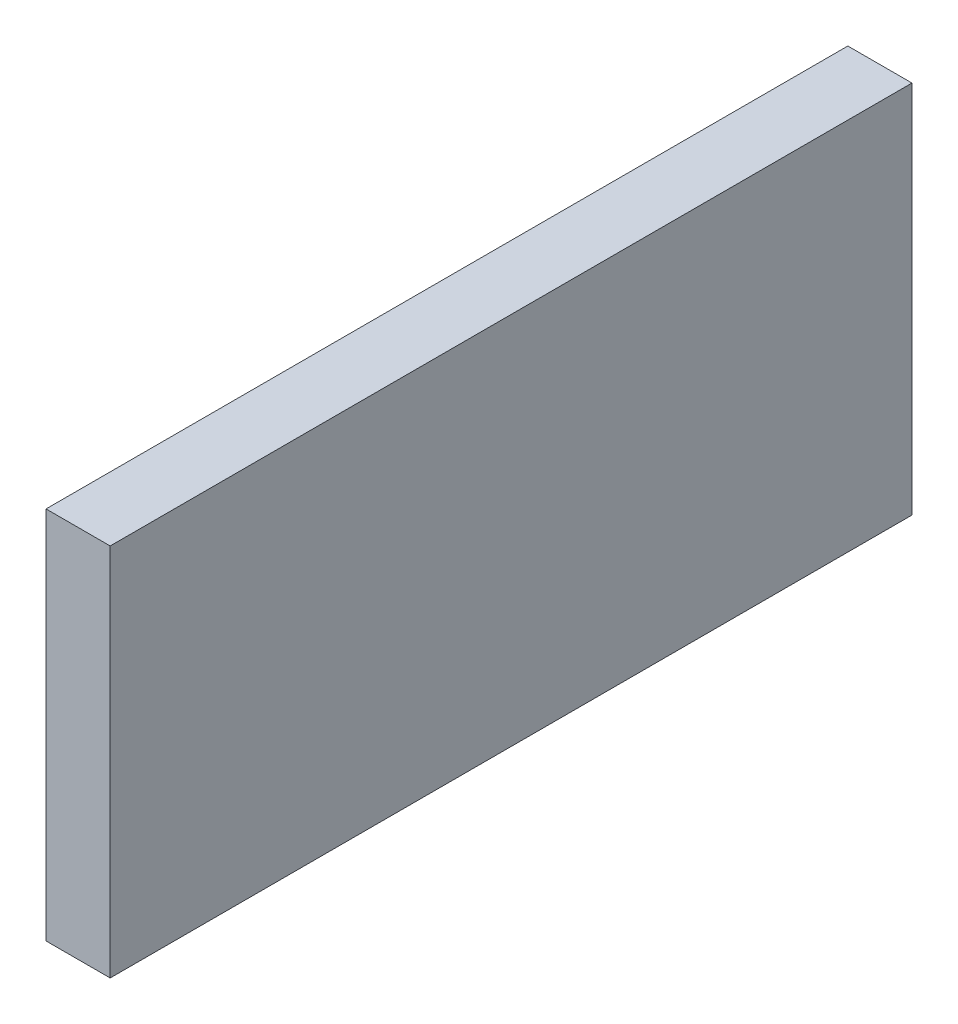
ISO-10303-21;
HEADER;
FILE_DESCRIPTION(('STEP AP214'),'2;1');
FILE_NAME('part.step','',(''),(''),'','','');
FILE_SCHEMA(('AUTOMOTIVE_DESIGN { 1 0 10303 214 1 1 1 1 }'));
ENDSEC;
DATA;
#1=APPLICATION_CONTEXT('core data for automotive mechanical design processes');
#2=APPLICATION_PROTOCOL_DEFINITION('international standard','automotive_design',2000,#1);
#3=PRODUCT_CONTEXT('',#1,'mechanical');
#4=PRODUCT('Part','Part','',(#3));
#5=PRODUCT_RELATED_PRODUCT_CATEGORY('part','',(#4));
#6=PRODUCT_DEFINITION_FORMATION('','',#4);
#7=PRODUCT_DEFINITION_CONTEXT('part definition',#1,'design');
#8=PRODUCT_DEFINITION('design','',#6,#7);
#9=PRODUCT_DEFINITION_SHAPE('','',#8);
#10=(LENGTH_UNIT() NAMED_UNIT(*) SI_UNIT(.MILLI.,.METRE.));
#11=(NAMED_UNIT(*) PLANE_ANGLE_UNIT() SI_UNIT($,.RADIAN.));
#12=(NAMED_UNIT(*) SI_UNIT($,.STERADIAN.) SOLID_ANGLE_UNIT());
#13=UNCERTAINTY_MEASURE_WITH_UNIT(LENGTH_MEASURE(1.E-05),#10,'distance_accuracy_value','');
#14=(GEOMETRIC_REPRESENTATION_CONTEXT(3) GLOBAL_UNCERTAINTY_ASSIGNED_CONTEXT((#13)) GLOBAL_UNIT_ASSIGNED_CONTEXT((#10,
#11,#12)) REPRESENTATION_CONTEXT('',''));
#15=CARTESIAN_POINT('',(0.,0.,0.));
#16=DIRECTION('',(0.,0.,1.));
#17=DIRECTION('',(1.,0.,0.));
#18=AXIS2_PLACEMENT_3D('',#15,#16,#17);
#19=CARTESIAN_POINT('',(12.,0.,0.));
#20=DIRECTION('',(0.,0.,-1.));
#21=DIRECTION('',(-1.,0.,0.));
#22=AXIS2_PLACEMENT_3D('',#19,#20,#21);
#23=PLANE('',#22);
#24=DIRECTION('',(0.,-1.,0.));
#25=VECTOR('',#24,1.);
#26=CARTESIAN_POINT('',(0.,0.,0.));
#27=LINE('',#26,#25);
#28=CARTESIAN_POINT('',(0.,70.,0.));
#29=VERTEX_POINT('',#28);
#30=CARTESIAN_POINT('',(0.,0.,0.));
#31=VERTEX_POINT('',#30);
#32=EDGE_CURVE('E96',#29,#31,#27,.T.);
#33=ORIENTED_EDGE('',*,*,#32,.T.);
#34=DIRECTION('',(-1.,0.,0.));
#35=VECTOR('',#34,1.);
#36=CARTESIAN_POINT('',(12.,0.,0.));
#37=LINE('',#36,#35);
#38=CARTESIAN_POINT('',(12.,0.,0.));
#39=VERTEX_POINT('',#38);
#40=EDGE_CURVE('E11',#39,#31,#37,.T.);
#41=ORIENTED_EDGE('',*,*,#40,.F.);
#42=DIRECTION('',(0.,-1.,0.));
#43=VECTOR('',#42,1.);
#44=CARTESIAN_POINT('',(12.,0.,0.));
#45=LINE('',#44,#43);
#46=CARTESIAN_POINT('',(12.,70.,0.));
#47=VERTEX_POINT('',#46);
#48=EDGE_CURVE('E84',#47,#39,#45,.T.);
#49=ORIENTED_EDGE('',*,*,#48,.F.);
#50=DIRECTION('',(-1.,0.,0.));
#51=VECTOR('',#50,1.);
#52=CARTESIAN_POINT('',(12.,70.,0.));
#53=LINE('',#52,#51);
#54=EDGE_CURVE('E92',#47,#29,#53,.T.);
#55=ORIENTED_EDGE('',*,*,#54,.T.);
#56=EDGE_LOOP('',(#33,#41,#49,#55));
#57=FACE_BOUND('',#56,.T.);
#58=ADVANCED_FACE('F33',(#57),#23,.F.);
#59=CARTESIAN_POINT('',(12.,0.,0.));
#60=DIRECTION('',(0.,1.,0.));
#61=DIRECTION('',(0.,0.,1.));
#62=AXIS2_PLACEMENT_3D('',#59,#60,#61);
#63=PLANE('',#62);
#64=DIRECTION('',(0.,0.,-1.));
#65=VECTOR('',#64,1.);
#66=CARTESIAN_POINT('',(0.,0.,0.));
#67=LINE('',#66,#65);
#68=CARTESIAN_POINT('',(0.,0.,-150.));
#69=VERTEX_POINT('',#68);
#70=EDGE_CURVE('E88',#31,#69,#67,.T.);
#71=ORIENTED_EDGE('',*,*,#70,.T.);
#72=DIRECTION('',(-1.,0.,0.));
#73=VECTOR('',#72,1.);
#74=CARTESIAN_POINT('',(12.,0.,-150.));
#75=LINE('',#74,#73);
#76=CARTESIAN_POINT('',(12.,0.,-150.));
#77=VERTEX_POINT('',#76);
#78=EDGE_CURVE('E41',#77,#69,#75,.T.);
#79=ORIENTED_EDGE('',*,*,#78,.F.);
#80=DIRECTION('',(0.,0.,-1.));
#81=VECTOR('',#80,1.);
#82=CARTESIAN_POINT('',(12.,0.,0.));
#83=LINE('',#82,#81);
#84=EDGE_CURVE('E79',#39,#77,#83,.T.);
#85=ORIENTED_EDGE('',*,*,#84,.F.);
#86=ORIENTED_EDGE('',*,*,#40,.T.);
#87=EDGE_LOOP('',(#71,#79,#85,#86));
#88=FACE_BOUND('',#87,.T.);
#89=ADVANCED_FACE('F87',(#88),#63,.F.);
#90=CARTESIAN_POINT('',(12.,0.,-150.));
#91=DIRECTION('',(0.,0.,1.));
#92=DIRECTION('',(1.,0.,0.));
#93=AXIS2_PLACEMENT_3D('',#90,#91,#92);
#94=PLANE('',#93);
#95=DIRECTION('',(0.,1.,0.));
#96=VECTOR('',#95,1.);
#97=CARTESIAN_POINT('',(0.,0.,-150.));
#98=LINE('',#97,#96);
#99=CARTESIAN_POINT('',(0.,70.,-150.));
#100=VERTEX_POINT('',#99);
#101=EDGE_CURVE('E66',#69,#100,#98,.T.);
#102=ORIENTED_EDGE('',*,*,#101,.T.);
#103=DIRECTION('',(-1.,0.,0.));
#104=VECTOR('',#103,1.);
#105=CARTESIAN_POINT('',(12.,70.,-150.));
#106=LINE('',#105,#104);
#107=CARTESIAN_POINT('',(12.,70.,-150.));
#108=VERTEX_POINT('',#107);
#109=EDGE_CURVE('E89',#108,#100,#106,.T.);
#110=ORIENTED_EDGE('',*,*,#109,.F.);
#111=DIRECTION('',(0.,1.,0.));
#112=VECTOR('',#111,1.);
#113=CARTESIAN_POINT('',(12.,0.,-150.));
#114=LINE('',#113,#112);
#115=EDGE_CURVE('E82',#77,#108,#114,.T.);
#116=ORIENTED_EDGE('',*,*,#115,.F.);
#117=ORIENTED_EDGE('',*,*,#78,.T.);
#118=EDGE_LOOP('',(#102,#110,#116,#117));
#119=FACE_BOUND('',#118,.T.);
#120=ADVANCED_FACE('F90',(#119),#94,.F.);
#121=CARTESIAN_POINT('',(12.,70.,0.));
#122=DIRECTION('',(0.,-1.,0.));
#123=DIRECTION('',(0.,0.,-1.));
#124=AXIS2_PLACEMENT_3D('',#121,#122,#123);
#125=PLANE('',#124);
#126=DIRECTION('',(0.,0.,1.));
#127=VECTOR('',#126,1.);
#128=CARTESIAN_POINT('',(0.,70.,0.));
#129=LINE('',#128,#127);
#130=EDGE_CURVE('E72',#100,#29,#129,.T.);
#131=ORIENTED_EDGE('',*,*,#130,.T.);
#132=ORIENTED_EDGE('',*,*,#54,.F.);
#133=DIRECTION('',(0.,0.,1.));
#134=VECTOR('',#133,1.);
#135=CARTESIAN_POINT('',(12.,70.,0.));
#136=LINE('',#135,#134);
#137=EDGE_CURVE('E49',#108,#47,#136,.T.);
#138=ORIENTED_EDGE('',*,*,#137,.F.);
#139=ORIENTED_EDGE('',*,*,#109,.T.);
#140=EDGE_LOOP('',(#131,#132,#138,#139));
#141=FACE_BOUND('',#140,.T.);
#142=ADVANCED_FACE('F103',(#141),#125,.F.);
#143=CARTESIAN_POINT('',(12.,0.,0.));
#144=DIRECTION('',(-1.,0.,0.));
#145=DIRECTION('',(0.,0.,1.));
#146=AXIS2_PLACEMENT_3D('',#143,#144,#145);
#147=PLANE('',#146);
#148=ORIENTED_EDGE('',*,*,#48,.T.);
#149=ORIENTED_EDGE('',*,*,#84,.T.);
#150=ORIENTED_EDGE('',*,*,#115,.T.);
#151=ORIENTED_EDGE('',*,*,#137,.T.);
#152=EDGE_LOOP('',(#148,#149,#150,#151));
#153=FACE_BOUND('',#152,.T.);
#154=ADVANCED_FACE('F80',(#153),#147,.F.);
#155=CARTESIAN_POINT('',(0.,0.,0.));
#156=DIRECTION('',(-1.,0.,0.));
#157=DIRECTION('',(0.,0.,1.));
#158=AXIS2_PLACEMENT_3D('',#155,#156,#157);
#159=PLANE('',#158);
#160=ORIENTED_EDGE('',*,*,#32,.F.);
#161=ORIENTED_EDGE('',*,*,#130,.F.);
#162=ORIENTED_EDGE('',*,*,#101,.F.);
#163=ORIENTED_EDGE('',*,*,#70,.F.);
#164=EDGE_LOOP('',(#160,#161,#162,#163));
#165=FACE_BOUND('',#164,.T.);
#166=ADVANCED_FACE('F106',(#165),#159,.T.);
#167=CLOSED_SHELL('',(#58,#89,#120,#142,#154,#166));
#168=MANIFOLD_SOLID_BREP('B2',#167);
#169=ADVANCED_BREP_SHAPE_REPRESENTATION('',(#18,#168),#14);
#170=SHAPE_DEFINITION_REPRESENTATION(#9,#169);
ENDSEC;
END-ISO-10303-21;
